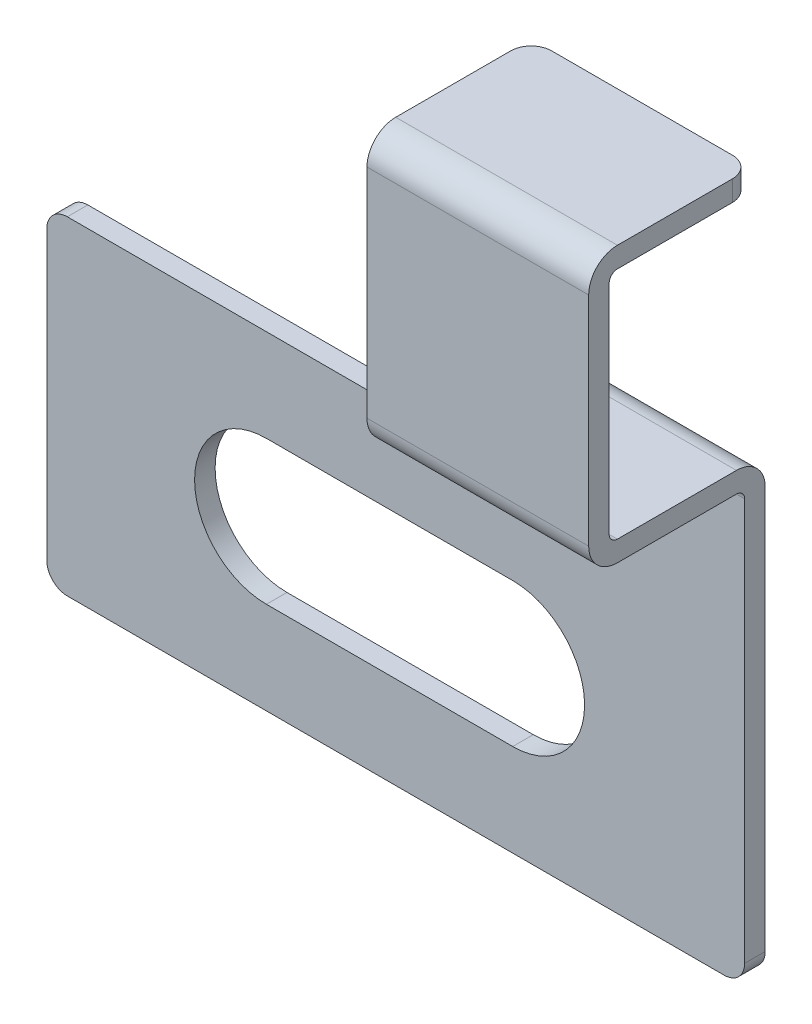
ISO-10303-21;
HEADER;
FILE_DESCRIPTION(('STEP AP214'),'2;1');
FILE_NAME('part.step','',(''),(''),'','','');
FILE_SCHEMA(('AUTOMOTIVE_DESIGN { 1 0 10303 214 1 1 1 1 }'));
ENDSEC;
DATA;
#1=APPLICATION_CONTEXT('core data for automotive mechanical design processes');
#2=APPLICATION_PROTOCOL_DEFINITION('international standard','automotive_design',2000,#1);
#3=PRODUCT_CONTEXT('',#1,'mechanical');
#4=PRODUCT('Part','Part','',(#3));
#5=PRODUCT_RELATED_PRODUCT_CATEGORY('part','',(#4));
#6=PRODUCT_DEFINITION_FORMATION('','',#4);
#7=PRODUCT_DEFINITION_CONTEXT('part definition',#1,'design');
#8=PRODUCT_DEFINITION('design','',#6,#7);
#9=PRODUCT_DEFINITION_SHAPE('','',#8);
#10=(LENGTH_UNIT() NAMED_UNIT(*) SI_UNIT(.MILLI.,.METRE.));
#11=(NAMED_UNIT(*) PLANE_ANGLE_UNIT() SI_UNIT($,.RADIAN.));
#12=(NAMED_UNIT(*) SI_UNIT($,.STERADIAN.) SOLID_ANGLE_UNIT());
#13=UNCERTAINTY_MEASURE_WITH_UNIT(LENGTH_MEASURE(1.E-05),#10,'distance_accuracy_value','');
#14=(GEOMETRIC_REPRESENTATION_CONTEXT(3) GLOBAL_UNCERTAINTY_ASSIGNED_CONTEXT((#13)) GLOBAL_UNIT_ASSIGNED_CONTEXT((#10,
#11,#12)) REPRESENTATION_CONTEXT('',''));
#15=CARTESIAN_POINT('',(0.,0.,0.));
#16=DIRECTION('',(0.,0.,1.));
#17=DIRECTION('',(1.,0.,0.));
#18=AXIS2_PLACEMENT_3D('',#15,#16,#17);
#19=CARTESIAN_POINT('',(-5.35,12.7,3.6));
#20=DIRECTION('',(0.,-1.,0.));
#21=DIRECTION('',(-1.,0.,0.));
#22=AXIS2_PLACEMENT_3D('',#19,#20,#21);
#23=PLANE('',#22);
#24=DIRECTION('',(1.,0.,0.));
#25=VECTOR('',#24,1.);
#26=CARTESIAN_POINT('',(-5.35,12.7,0.3));
#27=LINE('',#26,#25);
#28=CARTESIAN_POINT('',(6.75,12.7,0.3));
#29=VERTEX_POINT('',#28);
#30=CARTESIAN_POINT('',(11.15,12.7,0.3));
#31=VERTEX_POINT('',#30);
#32=EDGE_CURVE('E281',#29,#31,#27,.T.);
#33=ORIENTED_EDGE('',*,*,#32,.T.);
#34=CARTESIAN_POINT('',(11.15,12.7,0.8));
#35=DIRECTION('',(0.,-1.,0.));
#36=DIRECTION('',(-1.,0.,0.));
#37=AXIS2_PLACEMENT_3D('',#34,#35,#36);
#38=CIRCLE('',#37,0.5);
#39=CARTESIAN_POINT('',(11.65,12.7,0.8));
#40=VERTEX_POINT('',#39);
#41=EDGE_CURVE('E396',#31,#40,#38,.T.);
#42=ORIENTED_EDGE('',*,*,#41,.T.);
#43=DIRECTION('',(0.,0.,-1.));
#44=VECTOR('',#43,1.);
#45=CARTESIAN_POINT('',(11.65,12.7,3.6));
#46=LINE('',#45,#44);
#47=CARTESIAN_POINT('',(11.65,12.7,3.6));
#48=VERTEX_POINT('',#47);
#49=EDGE_CURVE('E273',#48,#40,#46,.T.);
#50=ORIENTED_EDGE('',*,*,#49,.F.);
#51=DIRECTION('',(1.,0.,0.));
#52=VECTOR('',#51,1.);
#53=CARTESIAN_POINT('',(-5.35,12.7,3.6));
#54=LINE('',#53,#52);
#55=CARTESIAN_POINT('',(6.25,12.7,3.6));
#56=VERTEX_POINT('',#55);
#57=EDGE_CURVE('E320',#56,#48,#54,.T.);
#58=ORIENTED_EDGE('',*,*,#57,.F.);
#59=DIRECTION('',(0.,0.,1.));
#60=VECTOR('',#59,1.);
#61=CARTESIAN_POINT('',(6.25,12.7,3.6));
#62=LINE('',#61,#60);
#63=CARTESIAN_POINT('',(6.25,12.7,0.8));
#64=VERTEX_POINT('',#63);
#65=EDGE_CURVE('E245',#64,#56,#62,.T.);
#66=ORIENTED_EDGE('',*,*,#65,.F.);
#67=CARTESIAN_POINT('',(6.75,12.7,0.8));
#68=DIRECTION('',(0.,-1.,0.));
#69=DIRECTION('',(-1.,0.,0.));
#70=AXIS2_PLACEMENT_3D('',#67,#68,#69);
#71=CIRCLE('',#70,0.5);
#72=EDGE_CURVE('E394',#64,#29,#71,.T.);
#73=ORIENTED_EDGE('',*,*,#72,.T.);
#74=EDGE_LOOP('',(#33,#42,#50,#58,#66,#73));
#75=FACE_BOUND('',#74,.T.);
#76=ADVANCED_FACE('F14',(#75),#23,.T.);
#77=CARTESIAN_POINT('',(-5.35,12.5,3.6));
#78=DIRECTION('',(1.,0.,0.));
#79=DIRECTION('',(0.,0.,-1.));
#80=AXIS2_PLACEMENT_3D('',#77,#78,#79);
#81=CYLINDRICAL_SURFACE('',#80,0.2);
#82=CARTESIAN_POINT('',(6.25,12.5,3.6));
#83=DIRECTION('',(1.,0.,0.));
#84=DIRECTION('',(0.,-1.,0.));
#85=AXIS2_PLACEMENT_3D('',#82,#83,#84);
#86=CIRCLE('',#85,0.2);
#87=CARTESIAN_POINT('',(6.25,12.5,3.8));
#88=VERTEX_POINT('',#87);
#89=EDGE_CURVE('E247',#56,#88,#86,.T.);
#90=ORIENTED_EDGE('',*,*,#89,.F.);
#91=ORIENTED_EDGE('',*,*,#57,.T.);
#92=CARTESIAN_POINT('',(11.65,12.5,3.6));
#93=DIRECTION('',(-1.,0.,0.));
#94=DIRECTION('',(0.,0.,1.));
#95=AXIS2_PLACEMENT_3D('',#92,#93,#94);
#96=CIRCLE('',#95,0.2);
#97=CARTESIAN_POINT('',(11.65,12.5,3.8));
#98=VERTEX_POINT('',#97);
#99=EDGE_CURVE('E278',#98,#48,#96,.T.);
#100=ORIENTED_EDGE('',*,*,#99,.F.);
#101=DIRECTION('',(1.,0.,0.));
#102=VECTOR('',#101,1.);
#103=CARTESIAN_POINT('',(-5.35,12.5,3.8));
#104=LINE('',#103,#102);
#105=EDGE_CURVE('E323',#88,#98,#104,.T.);
#106=ORIENTED_EDGE('',*,*,#105,.F.);
#107=EDGE_LOOP('',(#90,#91,#100,#106));
#108=FACE_BOUND('',#107,.T.);
#109=ADVANCED_FACE('F468',(#108),#81,.F.);
#110=CARTESIAN_POINT('',(-5.35,7.2,3.8));
#111=DIRECTION('',(0.,0.,-1.));
#112=DIRECTION('',(-1.,0.,0.));
#113=AXIS2_PLACEMENT_3D('',#110,#111,#112);
#114=PLANE('',#113);
#115=DIRECTION('',(0.,-1.,0.));
#116=VECTOR('',#115,1.);
#117=CARTESIAN_POINT('',(6.25,7.2,3.8));
#118=LINE('',#117,#116);
#119=CARTESIAN_POINT('',(6.25,7.2,3.8));
#120=VERTEX_POINT('',#119);
#121=EDGE_CURVE('E249',#88,#120,#118,.T.);
#122=ORIENTED_EDGE('',*,*,#121,.F.);
#123=ORIENTED_EDGE('',*,*,#105,.T.);
#124=DIRECTION('',(0.,1.,0.));
#125=VECTOR('',#124,1.);
#126=CARTESIAN_POINT('',(11.65,7.2,3.8));
#127=LINE('',#126,#125);
#128=CARTESIAN_POINT('',(11.65,7.2,3.8));
#129=VERTEX_POINT('',#128);
#130=EDGE_CURVE('E315',#129,#98,#127,.T.);
#131=ORIENTED_EDGE('',*,*,#130,.F.);
#132=DIRECTION('',(1.,0.,0.));
#133=VECTOR('',#132,1.);
#134=CARTESIAN_POINT('',(-5.35,7.2,3.8));
#135=LINE('',#134,#133);
#136=EDGE_CURVE('E325',#120,#129,#135,.T.);
#137=ORIENTED_EDGE('',*,*,#136,.F.);
#138=EDGE_LOOP('',(#122,#123,#131,#137));
#139=FACE_BOUND('',#138,.T.);
#140=ADVANCED_FACE('F475',(#139),#114,.T.);
#141=CARTESIAN_POINT('',(-5.35,7.2,3.6));
#142=DIRECTION('',(1.,0.,0.));
#143=DIRECTION('',(0.,0.,-1.));
#144=AXIS2_PLACEMENT_3D('',#141,#142,#143);
#145=CYLINDRICAL_SURFACE('',#144,0.2);
#146=CARTESIAN_POINT('',(6.25,7.2,3.6));
#147=DIRECTION('',(1.,0.,0.));
#148=DIRECTION('',(0.,-1.,0.));
#149=AXIS2_PLACEMENT_3D('',#146,#147,#148);
#150=CIRCLE('',#149,0.2);
#151=CARTESIAN_POINT('',(6.25,7.,3.6));
#152=VERTEX_POINT('',#151);
#153=EDGE_CURVE('E251',#120,#152,#150,.T.);
#154=ORIENTED_EDGE('',*,*,#153,.F.);
#155=ORIENTED_EDGE('',*,*,#136,.T.);
#156=CARTESIAN_POINT('',(11.65,7.2,3.6));
#157=DIRECTION('',(-1.,0.,0.));
#158=DIRECTION('',(0.,0.,1.));
#159=AXIS2_PLACEMENT_3D('',#156,#157,#158);
#160=CIRCLE('',#159,0.2);
#161=CARTESIAN_POINT('',(11.65,7.,3.6));
#162=VERTEX_POINT('',#161);
#163=EDGE_CURVE('E312',#162,#129,#160,.T.);
#164=ORIENTED_EDGE('',*,*,#163,.F.);
#165=DIRECTION('',(1.,0.,0.));
#166=VECTOR('',#165,1.);
#167=CARTESIAN_POINT('',(-5.35,7.,3.6));
#168=LINE('',#167,#166);
#169=EDGE_CURVE('E327',#152,#162,#168,.T.);
#170=ORIENTED_EDGE('',*,*,#169,.F.);
#171=EDGE_LOOP('',(#154,#155,#164,#170));
#172=FACE_BOUND('',#171,.T.);
#173=ADVANCED_FACE('F502',(#172),#145,.F.);
#174=CARTESIAN_POINT('',(-5.35,7.,0.7));
#175=DIRECTION('',(0.,1.,0.));
#176=DIRECTION('',(0.,0.,1.));
#177=AXIS2_PLACEMENT_3D('',#174,#175,#176);
#178=PLANE('',#177);
#179=DIRECTION('',(0.,0.,-1.));
#180=VECTOR('',#179,1.);
#181=CARTESIAN_POINT('',(6.25,7.,0.7));
#182=LINE('',#181,#180);
#183=CARTESIAN_POINT('',(6.25,7.,0.7));
#184=VERTEX_POINT('',#183);
#185=EDGE_CURVE('E253',#152,#184,#182,.T.);
#186=ORIENTED_EDGE('',*,*,#185,.F.);
#187=ORIENTED_EDGE('',*,*,#169,.T.);
#188=DIRECTION('',(0.,0.,1.));
#189=VECTOR('',#188,1.);
#190=CARTESIAN_POINT('',(11.65,7.,0.7));
#191=LINE('',#190,#189);
#192=CARTESIAN_POINT('',(11.65,7.,0.7));
#193=VERTEX_POINT('',#192);
#194=EDGE_CURVE('E309',#193,#162,#191,.T.);
#195=ORIENTED_EDGE('',*,*,#194,.F.);
#196=DIRECTION('',(1.,0.,0.));
#197=VECTOR('',#196,1.);
#198=CARTESIAN_POINT('',(-5.35,7.,0.7));
#199=LINE('',#198,#197);
#200=EDGE_CURVE('E329',#184,#193,#199,.T.);
#201=ORIENTED_EDGE('',*,*,#200,.F.);
#202=EDGE_LOOP('',(#186,#187,#195,#201));
#203=FACE_BOUND('',#202,.T.);
#204=ADVANCED_FACE('F506',(#203),#178,.T.);
#205=CARTESIAN_POINT('',(-5.35,6.3,0.7));
#206=DIRECTION('',(1.,0.,0.));
#207=DIRECTION('',(0.,0.,-1.));
#208=AXIS2_PLACEMENT_3D('',#205,#206,#207);
#209=CYLINDRICAL_SURFACE('',#208,0.7);
#210=CARTESIAN_POINT('',(6.25,6.3,0.7));
#211=DIRECTION('',(1.,0.,0.));
#212=DIRECTION('',(0.,-1.,0.));
#213=AXIS2_PLACEMENT_3D('',#210,#211,#212);
#214=CIRCLE('',#213,0.7);
#215=CARTESIAN_POINT('',(6.25,6.3,0.));
#216=VERTEX_POINT('',#215);
#217=EDGE_CURVE('E255',#184,#216,#214,.F.);
#218=ORIENTED_EDGE('',*,*,#217,.F.);
#219=ORIENTED_EDGE('',*,*,#200,.T.);
#220=CARTESIAN_POINT('',(11.65,6.3,0.7));
#221=DIRECTION('',(1.,0.,0.));
#222=DIRECTION('',(0.,0.,-1.));
#223=AXIS2_PLACEMENT_3D('',#220,#221,#222);
#224=CIRCLE('',#223,0.7);
#225=CARTESIAN_POINT('',(11.65,6.3,0.));
#226=VERTEX_POINT('',#225);
#227=EDGE_CURVE('E306',#226,#193,#224,.T.);
#228=ORIENTED_EDGE('',*,*,#227,.F.);
#229=DIRECTION('',(1.,0.,0.));
#230=VECTOR('',#229,1.);
#231=CARTESIAN_POINT('',(-5.35,6.3,0.));
#232=LINE('',#231,#230);
#233=EDGE_CURVE('E331',#216,#226,#232,.T.);
#234=ORIENTED_EDGE('',*,*,#233,.F.);
#235=EDGE_LOOP('',(#218,#219,#228,#234));
#236=FACE_BOUND('',#235,.T.);
#237=ADVANCED_FACE('F429',(#236),#209,.T.);
#238=CARTESIAN_POINT('',(-5.35,6.3,0.));
#239=DIRECTION('',(0.,0.,-1.));
#240=DIRECTION('',(0.,1.,0.));
#241=AXIS2_PLACEMENT_3D('',#238,#239,#240);
#242=PLANE('',#241);
#243=CARTESIAN_POINT('',(0.,0.,0.));
#244=DIRECTION('',(0.,0.,-1.));
#245=DIRECTION('',(0.,1.,0.));
#246=AXIS2_PLACEMENT_3D('',#243,#244,#245);
#247=CIRCLE('',#246,1.75);
#248=CARTESIAN_POINT('',(0.,-1.75,0.));
#249=VERTEX_POINT('',#248);
#250=CARTESIAN_POINT('',(0.,1.75,0.));
#251=VERTEX_POINT('',#250);
#252=EDGE_CURVE('E231',#249,#251,#247,.T.);
#253=ORIENTED_EDGE('',*,*,#252,.F.);
#254=DIRECTION('',(-1.,0.,0.));
#255=VECTOR('',#254,1.);
#256=CARTESIAN_POINT('',(-5.35,-1.75,0.));
#257=LINE('',#256,#255);
#258=CARTESIAN_POINT('',(6.,-1.75,0.));
#259=VERTEX_POINT('',#258);
#260=EDGE_CURVE('E224',#259,#249,#257,.T.);
#261=ORIENTED_EDGE('',*,*,#260,.F.);
#262=CARTESIAN_POINT('',(6.,0.,0.));
#263=DIRECTION('',(0.,0.,-1.));
#264=DIRECTION('',(0.,1.,0.));
#265=AXIS2_PLACEMENT_3D('',#262,#263,#264);
#266=CIRCLE('',#265,1.75);
#267=CARTESIAN_POINT('',(6.,1.75,0.));
#268=VERTEX_POINT('',#267);
#269=EDGE_CURVE('E204',#268,#259,#266,.T.);
#270=ORIENTED_EDGE('',*,*,#269,.F.);
#271=DIRECTION('',(1.,0.,0.));
#272=VECTOR('',#271,1.);
#273=CARTESIAN_POINT('',(-5.35,1.75,0.));
#274=LINE('',#273,#272);
#275=EDGE_CURVE('E229',#251,#268,#274,.T.);
#276=ORIENTED_EDGE('',*,*,#275,.F.);
#277=EDGE_LOOP('',(#253,#261,#270,#276));
#278=FACE_BOUND('',#277,.T.);
#279=DIRECTION('',(0.,1.,0.));
#280=VECTOR('',#279,1.);
#281=CARTESIAN_POINT('',(11.65,6.3,0.));
#282=LINE('',#281,#280);
#283=CARTESIAN_POINT('',(11.65,-3.5,0.));
#284=VERTEX_POINT('',#283);
#285=EDGE_CURVE('E304',#284,#226,#282,.T.);
#286=ORIENTED_EDGE('',*,*,#285,.F.);
#287=CARTESIAN_POINT('',(11.15,-3.5,0.));
#288=DIRECTION('',(0.,0.,-1.));
#289=DIRECTION('',(0.,1.,0.));
#290=AXIS2_PLACEMENT_3D('',#287,#288,#289);
#291=CIRCLE('',#290,0.5);
#292=CARTESIAN_POINT('',(11.15,-4.,0.));
#293=VERTEX_POINT('',#292);
#294=EDGE_CURVE('E376',#284,#293,#291,.T.);
#295=ORIENTED_EDGE('',*,*,#294,.T.);
#296=DIRECTION('',(1.,0.,0.));
#297=VECTOR('',#296,1.);
#298=CARTESIAN_POINT('',(-5.35,-4.,0.));
#299=LINE('',#298,#297);
#300=CARTESIAN_POINT('',(-4.85,-4.,0.));
#301=VERTEX_POINT('',#300);
#302=EDGE_CURVE('E334',#301,#293,#299,.T.);
#303=ORIENTED_EDGE('',*,*,#302,.F.);
#304=CARTESIAN_POINT('',(-4.85,-3.5,0.));
#305=DIRECTION('',(0.,0.,-1.));
#306=DIRECTION('',(0.,1.,0.));
#307=AXIS2_PLACEMENT_3D('',#304,#305,#306);
#308=CIRCLE('',#307,0.5);
#309=CARTESIAN_POINT('',(-5.35,-3.5,0.));
#310=VERTEX_POINT('',#309);
#311=EDGE_CURVE('E374',#301,#310,#308,.T.);
#312=ORIENTED_EDGE('',*,*,#311,.T.);
#313=DIRECTION('',(0.,1.,0.));
#314=VECTOR('',#313,1.);
#315=CARTESIAN_POINT('',(-5.35,6.3,0.));
#316=LINE('',#315,#314);
#317=CARTESIAN_POINT('',(-5.35,3.5,0.));
#318=VERTEX_POINT('',#317);
#319=EDGE_CURVE('E277',#310,#318,#316,.T.);
#320=ORIENTED_EDGE('',*,*,#319,.T.);
#321=CARTESIAN_POINT('',(-4.85,3.5,0.));
#322=DIRECTION('',(0.,0.,-1.));
#323=DIRECTION('',(0.,1.,0.));
#324=AXIS2_PLACEMENT_3D('',#321,#322,#323);
#325=CIRCLE('',#324,0.5);
#326=CARTESIAN_POINT('',(-4.85,4.,0.));
#327=VERTEX_POINT('',#326);
#328=EDGE_CURVE('E372',#318,#327,#325,.T.);
#329=ORIENTED_EDGE('',*,*,#328,.T.);
#330=DIRECTION('',(1.,0.,0.));
#331=VECTOR('',#330,1.);
#332=CARTESIAN_POINT('',(-5.35,4.,0.));
#333=LINE('',#332,#331);
#334=CARTESIAN_POINT('',(5.75,4.,0.));
#335=VERTEX_POINT('',#334);
#336=EDGE_CURVE('E234',#327,#335,#333,.T.);
#337=ORIENTED_EDGE('',*,*,#336,.T.);
#338=CARTESIAN_POINT('',(5.75,4.5,0.));
#339=DIRECTION('',(0.,0.,-1.));
#340=DIRECTION('',(0.,1.,0.));
#341=AXIS2_PLACEMENT_3D('',#338,#339,#340);
#342=CIRCLE('',#341,0.5);
#343=CARTESIAN_POINT('',(6.25,4.5,0.));
#344=VERTEX_POINT('',#343);
#345=EDGE_CURVE('E9',#335,#344,#342,.F.);
#346=ORIENTED_EDGE('',*,*,#345,.T.);
#347=DIRECTION('',(0.,1.,0.));
#348=VECTOR('',#347,1.);
#349=CARTESIAN_POINT('',(6.25,13.2,0.));
#350=LINE('',#349,#348);
#351=EDGE_CURVE('E237',#344,#216,#350,.T.);
#352=ORIENTED_EDGE('',*,*,#351,.T.);
#353=ORIENTED_EDGE('',*,*,#233,.T.);
#354=EDGE_LOOP('',(#286,#295,#303,#312,#320,#329,#337,#346,#352,#353));
#355=FACE_BOUND('',#354,.T.);
#356=ADVANCED_FACE('F419',(#278,#355),#242,.T.);
#357=CARTESIAN_POINT('',(-5.35,-4.,0.));
#358=DIRECTION('',(0.,1.,0.));
#359=DIRECTION('',(1.,0.,0.));
#360=AXIS2_PLACEMENT_3D('',#357,#358,#359);
#361=PLANE('',#360);
#362=ORIENTED_EDGE('',*,*,#302,.T.);
#363=DIRECTION('',(0.,0.,1.));
#364=VECTOR('',#363,1.);
#365=CARTESIAN_POINT('',(11.15,-4.,0.5));
#366=LINE('',#365,#364);
#367=CARTESIAN_POINT('',(11.15,-4.,0.5));
#368=VERTEX_POINT('',#367);
#369=EDGE_CURVE('E359',#293,#368,#366,.T.);
#370=ORIENTED_EDGE('',*,*,#369,.T.);
#371=DIRECTION('',(1.,0.,0.));
#372=VECTOR('',#371,1.);
#373=CARTESIAN_POINT('',(-5.35,-4.,0.5));
#374=LINE('',#373,#372);
#375=CARTESIAN_POINT('',(-4.85,-4.,0.5));
#376=VERTEX_POINT('',#375);
#377=EDGE_CURVE('E337',#376,#368,#374,.T.);
#378=ORIENTED_EDGE('',*,*,#377,.F.);
#379=DIRECTION('',(0.,0.,1.));
#380=VECTOR('',#379,1.);
#381=CARTESIAN_POINT('',(-4.85,-4.,0.));
#382=LINE('',#381,#380);
#383=EDGE_CURVE('E322',#376,#301,#382,.F.);
#384=ORIENTED_EDGE('',*,*,#383,.T.);
#385=EDGE_LOOP('',(#362,#370,#378,#384));
#386=FACE_BOUND('',#385,.T.);
#387=ADVANCED_FACE('F439',(#386),#361,.F.);
#388=CARTESIAN_POINT('',(-5.35,6.3,0.5));
#389=DIRECTION('',(0.,0.,-1.));
#390=DIRECTION('',(0.,1.,0.));
#391=AXIS2_PLACEMENT_3D('',#388,#389,#390);
#392=PLANE('',#391);
#393=DIRECTION('',(1.,0.,0.));
#394=VECTOR('',#393,1.);
#395=CARTESIAN_POINT('',(0.,-1.75,0.5));
#396=LINE('',#395,#394);
#397=CARTESIAN_POINT('',(0.,-1.75,0.5));
#398=VERTEX_POINT('',#397);
#399=CARTESIAN_POINT('',(6.,-1.75,0.5));
#400=VERTEX_POINT('',#399);
#401=EDGE_CURVE('E210',#398,#400,#396,.T.);
#402=ORIENTED_EDGE('',*,*,#401,.F.);
#403=CARTESIAN_POINT('',(0.,0.,0.5));
#404=DIRECTION('',(0.,0.,1.));
#405=DIRECTION('',(0.,1.,0.));
#406=AXIS2_PLACEMENT_3D('',#403,#404,#405);
#407=CIRCLE('',#406,1.75);
#408=CARTESIAN_POINT('',(0.,1.75,0.5));
#409=VERTEX_POINT('',#408);
#410=EDGE_CURVE('E37',#409,#398,#407,.T.);
#411=ORIENTED_EDGE('',*,*,#410,.F.);
#412=DIRECTION('',(-1.,0.,0.));
#413=VECTOR('',#412,1.);
#414=CARTESIAN_POINT('',(0.,1.75,0.5));
#415=LINE('',#414,#413);
#416=CARTESIAN_POINT('',(6.,1.75,0.5));
#417=VERTEX_POINT('',#416);
#418=EDGE_CURVE('E217',#417,#409,#415,.T.);
#419=ORIENTED_EDGE('',*,*,#418,.F.);
#420=CARTESIAN_POINT('',(6.,0.,0.5));
#421=DIRECTION('',(0.,0.,1.));
#422=DIRECTION('',(0.,1.,0.));
#423=AXIS2_PLACEMENT_3D('',#420,#421,#422);
#424=CIRCLE('',#423,1.75);
#425=EDGE_CURVE('E201',#400,#417,#424,.T.);
#426=ORIENTED_EDGE('',*,*,#425,.F.);
#427=EDGE_LOOP('',(#402,#411,#419,#426));
#428=FACE_BOUND('',#427,.T.);
#429=ORIENTED_EDGE('',*,*,#377,.T.);
#430=CARTESIAN_POINT('',(11.15,-3.5,0.5));
#431=DIRECTION('',(0.,0.,-1.));
#432=DIRECTION('',(0.,1.,0.));
#433=AXIS2_PLACEMENT_3D('',#430,#431,#432);
#434=CIRCLE('',#433,0.5);
#435=CARTESIAN_POINT('',(11.65,-3.5,0.5));
#436=VERTEX_POINT('',#435);
#437=EDGE_CURVE('E366',#368,#436,#434,.F.);
#438=ORIENTED_EDGE('',*,*,#437,.T.);
#439=DIRECTION('',(0.,1.,0.));
#440=VECTOR('',#439,1.);
#441=CARTESIAN_POINT('',(11.65,6.3,0.5));
#442=LINE('',#441,#440);
#443=CARTESIAN_POINT('',(11.65,6.3,0.5));
#444=VERTEX_POINT('',#443);
#445=EDGE_CURVE('E302',#436,#444,#442,.T.);
#446=ORIENTED_EDGE('',*,*,#445,.T.);
#447=DIRECTION('',(1.,0.,0.));
#448=VECTOR('',#447,1.);
#449=CARTESIAN_POINT('',(-5.35,6.3,0.5));
#450=LINE('',#449,#448);
#451=CARTESIAN_POINT('',(6.25,6.3,0.5));
#452=VERTEX_POINT('',#451);
#453=EDGE_CURVE('E340',#452,#444,#450,.T.);
#454=ORIENTED_EDGE('',*,*,#453,.F.);
#455=DIRECTION('',(0.,-1.,0.));
#456=VECTOR('',#455,1.);
#457=CARTESIAN_POINT('',(6.25,6.3,0.5));
#458=LINE('',#457,#456);
#459=CARTESIAN_POINT('',(6.25,4.5,0.5));
#460=VERTEX_POINT('',#459);
#461=EDGE_CURVE('E270',#452,#460,#458,.T.);
#462=ORIENTED_EDGE('',*,*,#461,.T.);
#463=CARTESIAN_POINT('',(5.75,4.5,0.5));
#464=DIRECTION('',(0.,0.,-1.));
#465=DIRECTION('',(0.,1.,0.));
#466=AXIS2_PLACEMENT_3D('',#463,#464,#465);
#467=CIRCLE('',#466,0.5);
#468=CARTESIAN_POINT('',(5.75,4.,0.5));
#469=VERTEX_POINT('',#468);
#470=EDGE_CURVE('E22',#460,#469,#467,.T.);
#471=ORIENTED_EDGE('',*,*,#470,.T.);
#472=DIRECTION('',(-1.,0.,0.));
#473=VECTOR('',#472,1.);
#474=CARTESIAN_POINT('',(-5.35,4.,0.5));
#475=LINE('',#474,#473);
#476=CARTESIAN_POINT('',(-4.85,4.,0.5));
#477=VERTEX_POINT('',#476);
#478=EDGE_CURVE('E242',#469,#477,#475,.T.);
#479=ORIENTED_EDGE('',*,*,#478,.T.);
#480=CARTESIAN_POINT('',(-4.85,3.5,0.5));
#481=DIRECTION('',(0.,0.,-1.));
#482=DIRECTION('',(0.,1.,0.));
#483=AXIS2_PLACEMENT_3D('',#480,#481,#482);
#484=CIRCLE('',#483,0.5);
#485=CARTESIAN_POINT('',(-5.35,3.5,0.5));
#486=VERTEX_POINT('',#485);
#487=EDGE_CURVE('E362',#477,#486,#484,.F.);
#488=ORIENTED_EDGE('',*,*,#487,.T.);
#489=DIRECTION('',(0.,1.,0.));
#490=VECTOR('',#489,1.);
#491=CARTESIAN_POINT('',(-5.35,6.3,0.5));
#492=LINE('',#491,#490);
#493=CARTESIAN_POINT('',(-5.35,-3.5,0.5));
#494=VERTEX_POINT('',#493);
#495=EDGE_CURVE('E274',#494,#486,#492,.T.);
#496=ORIENTED_EDGE('',*,*,#495,.F.);
#497=CARTESIAN_POINT('',(-4.85,-3.5,0.5));
#498=DIRECTION('',(0.,0.,-1.));
#499=DIRECTION('',(0.,1.,0.));
#500=AXIS2_PLACEMENT_3D('',#497,#498,#499);
#501=CIRCLE('',#500,0.5);
#502=EDGE_CURVE('E364',#494,#376,#501,.F.);
#503=ORIENTED_EDGE('',*,*,#502,.T.);
#504=EDGE_LOOP('',(#429,#438,#446,#454,#462,#471,#479,#488,#496,#503));
#505=FACE_BOUND('',#504,.T.);
#506=ADVANCED_FACE('F214',(#428,#505),#392,.F.);
#507=CARTESIAN_POINT('',(-5.35,6.3,0.7));
#508=DIRECTION('',(1.,0.,0.));
#509=DIRECTION('',(0.,0.,-1.));
#510=AXIS2_PLACEMENT_3D('',#507,#508,#509);
#511=CYLINDRICAL_SURFACE('',#510,0.2);
#512=DIRECTION('',(1.,0.,0.));
#513=VECTOR('',#512,1.);
#514=CARTESIAN_POINT('',(-5.35,6.5,0.7));
#515=LINE('',#514,#513);
#516=CARTESIAN_POINT('',(6.25,6.5,0.7));
#517=VERTEX_POINT('',#516);
#518=CARTESIAN_POINT('',(11.65,6.5,0.7));
#519=VERTEX_POINT('',#518);
#520=EDGE_CURVE('E343',#517,#519,#515,.T.);
#521=ORIENTED_EDGE('',*,*,#520,.F.);
#522=CARTESIAN_POINT('',(6.25,6.3,0.7));
#523=DIRECTION('',(1.,0.,0.));
#524=DIRECTION('',(0.,-1.,0.));
#525=AXIS2_PLACEMENT_3D('',#522,#523,#524);
#526=CIRCLE('',#525,0.2);
#527=EDGE_CURVE('E267',#517,#452,#526,.F.);
#528=ORIENTED_EDGE('',*,*,#527,.T.);
#529=ORIENTED_EDGE('',*,*,#453,.T.);
#530=CARTESIAN_POINT('',(11.65,6.3,0.7));
#531=DIRECTION('',(1.,0.,0.));
#532=DIRECTION('',(0.,0.,-1.));
#533=AXIS2_PLACEMENT_3D('',#530,#531,#532);
#534=CIRCLE('',#533,0.2);
#535=EDGE_CURVE('E299',#444,#519,#534,.T.);
#536=ORIENTED_EDGE('',*,*,#535,.T.);
#537=EDGE_LOOP('',(#521,#528,#529,#536));
#538=FACE_BOUND('',#537,.T.);
#539=ADVANCED_FACE('F520',(#538),#511,.F.);
#540=CARTESIAN_POINT('',(-5.35,6.5,0.7));
#541=DIRECTION('',(0.,1.,0.));
#542=DIRECTION('',(0.,0.,1.));
#543=AXIS2_PLACEMENT_3D('',#540,#541,#542);
#544=PLANE('',#543);
#545=DIRECTION('',(1.,0.,0.));
#546=VECTOR('',#545,1.);
#547=CARTESIAN_POINT('',(-5.35,6.5,3.6));
#548=LINE('',#547,#546);
#549=CARTESIAN_POINT('',(6.25,6.5,3.6));
#550=VERTEX_POINT('',#549);
#551=CARTESIAN_POINT('',(11.65,6.5,3.6));
#552=VERTEX_POINT('',#551);
#553=EDGE_CURVE('E345',#550,#552,#548,.T.);
#554=ORIENTED_EDGE('',*,*,#553,.F.);
#555=DIRECTION('',(0.,0.,-1.));
#556=VECTOR('',#555,1.);
#557=CARTESIAN_POINT('',(6.25,6.5,0.7));
#558=LINE('',#557,#556);
#559=EDGE_CURVE('E264',#550,#517,#558,.T.);
#560=ORIENTED_EDGE('',*,*,#559,.T.);
#561=ORIENTED_EDGE('',*,*,#520,.T.);
#562=DIRECTION('',(0.,0.,1.));
#563=VECTOR('',#562,1.);
#564=CARTESIAN_POINT('',(11.65,6.5,0.7));
#565=LINE('',#564,#563);
#566=EDGE_CURVE('E296',#519,#552,#565,.T.);
#567=ORIENTED_EDGE('',*,*,#566,.T.);
#568=EDGE_LOOP('',(#554,#560,#561,#567));
#569=FACE_BOUND('',#568,.T.);
#570=ADVANCED_FACE('F523',(#569),#544,.F.);
#571=CARTESIAN_POINT('',(-5.35,7.2,3.6));
#572=DIRECTION('',(1.,0.,0.));
#573=DIRECTION('',(0.,0.,-1.));
#574=AXIS2_PLACEMENT_3D('',#571,#572,#573);
#575=CYLINDRICAL_SURFACE('',#574,0.7);
#576=DIRECTION('',(1.,0.,0.));
#577=VECTOR('',#576,1.);
#578=CARTESIAN_POINT('',(-5.35,7.2,4.3));
#579=LINE('',#578,#577);
#580=CARTESIAN_POINT('',(6.25,7.2,4.3));
#581=VERTEX_POINT('',#580);
#582=CARTESIAN_POINT('',(11.65,7.2,4.3));
#583=VERTEX_POINT('',#582);
#584=EDGE_CURVE('E347',#581,#583,#579,.T.);
#585=ORIENTED_EDGE('',*,*,#584,.F.);
#586=CARTESIAN_POINT('',(6.25,7.2,3.6));
#587=DIRECTION('',(1.,0.,0.));
#588=DIRECTION('',(0.,-1.,0.));
#589=AXIS2_PLACEMENT_3D('',#586,#587,#588);
#590=CIRCLE('',#589,0.7);
#591=EDGE_CURVE('E261',#581,#550,#590,.T.);
#592=ORIENTED_EDGE('',*,*,#591,.T.);
#593=ORIENTED_EDGE('',*,*,#553,.T.);
#594=CARTESIAN_POINT('',(11.65,7.2,3.6));
#595=DIRECTION('',(1.,0.,0.));
#596=DIRECTION('',(0.,0.,-1.));
#597=AXIS2_PLACEMENT_3D('',#594,#595,#596);
#598=CIRCLE('',#597,0.7);
#599=EDGE_CURVE('E293',#552,#583,#598,.F.);
#600=ORIENTED_EDGE('',*,*,#599,.T.);
#601=EDGE_LOOP('',(#585,#592,#593,#600));
#602=FACE_BOUND('',#601,.T.);
#603=ADVANCED_FACE('F527',(#602),#575,.T.);
#604=CARTESIAN_POINT('',(-5.35,7.2,4.3));
#605=DIRECTION('',(0.,0.,-1.));
#606=DIRECTION('',(-1.,0.,0.));
#607=AXIS2_PLACEMENT_3D('',#604,#605,#606);
#608=PLANE('',#607);
#609=DIRECTION('',(1.,0.,0.));
#610=VECTOR('',#609,1.);
#611=CARTESIAN_POINT('',(-5.35,12.5,4.3));
#612=LINE('',#611,#610);
#613=CARTESIAN_POINT('',(6.25,12.5,4.3));
#614=VERTEX_POINT('',#613);
#615=CARTESIAN_POINT('',(11.65,12.5,4.3));
#616=VERTEX_POINT('',#615);
#617=EDGE_CURVE('E349',#614,#616,#612,.T.);
#618=ORIENTED_EDGE('',*,*,#617,.F.);
#619=DIRECTION('',(0.,1.,0.));
#620=VECTOR('',#619,1.);
#621=CARTESIAN_POINT('',(6.25,13.2,4.3));
#622=LINE('',#621,#620);
#623=EDGE_CURVE('E233',#581,#614,#622,.T.);
#624=ORIENTED_EDGE('',*,*,#623,.F.);
#625=ORIENTED_EDGE('',*,*,#584,.T.);
#626=DIRECTION('',(0.,1.,0.));
#627=VECTOR('',#626,1.);
#628=CARTESIAN_POINT('',(11.65,7.2,4.3));
#629=LINE('',#628,#627);
#630=EDGE_CURVE('E290',#583,#616,#629,.T.);
#631=ORIENTED_EDGE('',*,*,#630,.T.);
#632=EDGE_LOOP('',(#618,#624,#625,#631));
#633=FACE_BOUND('',#632,.T.);
#634=ADVANCED_FACE('F531',(#633),#608,.F.);
#635=CARTESIAN_POINT('',(-5.35,12.5,3.6));
#636=DIRECTION('',(1.,0.,0.));
#637=DIRECTION('',(0.,0.,-1.));
#638=AXIS2_PLACEMENT_3D('',#635,#636,#637);
#639=CYLINDRICAL_SURFACE('',#638,0.7);
#640=DIRECTION('',(1.,0.,0.));
#641=VECTOR('',#640,1.);
#642=CARTESIAN_POINT('',(-5.35,13.2,3.6));
#643=LINE('',#642,#641);
#644=CARTESIAN_POINT('',(6.25,13.2,3.6));
#645=VERTEX_POINT('',#644);
#646=CARTESIAN_POINT('',(11.65,13.2,3.6));
#647=VERTEX_POINT('',#646);
#648=EDGE_CURVE('E351',#645,#647,#643,.T.);
#649=ORIENTED_EDGE('',*,*,#648,.F.);
#650=CARTESIAN_POINT('',(6.25,12.5,3.6));
#651=DIRECTION('',(1.,0.,0.));
#652=DIRECTION('',(0.,-1.,0.));
#653=AXIS2_PLACEMENT_3D('',#650,#651,#652);
#654=CIRCLE('',#653,0.7);
#655=EDGE_CURVE('E258',#645,#614,#654,.T.);
#656=ORIENTED_EDGE('',*,*,#655,.T.);
#657=ORIENTED_EDGE('',*,*,#617,.T.);
#658=CARTESIAN_POINT('',(11.65,12.5,3.6));
#659=DIRECTION('',(1.,0.,0.));
#660=DIRECTION('',(0.,0.,-1.));
#661=AXIS2_PLACEMENT_3D('',#658,#659,#660);
#662=CIRCLE('',#661,0.7);
#663=EDGE_CURVE('E287',#616,#647,#662,.F.);
#664=ORIENTED_EDGE('',*,*,#663,.T.);
#665=EDGE_LOOP('',(#649,#656,#657,#664));
#666=FACE_BOUND('',#665,.T.);
#667=ADVANCED_FACE('F535',(#666),#639,.T.);
#668=CARTESIAN_POINT('',(-5.35,13.2,3.6));
#669=DIRECTION('',(0.,-1.,0.));
#670=DIRECTION('',(-1.,0.,0.));
#671=AXIS2_PLACEMENT_3D('',#668,#669,#670);
#672=PLANE('',#671);
#673=DIRECTION('',(0.,0.,-1.));
#674=VECTOR('',#673,1.);
#675=CARTESIAN_POINT('',(11.65,13.2,3.6));
#676=LINE('',#675,#674);
#677=CARTESIAN_POINT('',(11.65,13.2,0.8));
#678=VERTEX_POINT('',#677);
#679=EDGE_CURVE('E284',#647,#678,#676,.T.);
#680=ORIENTED_EDGE('',*,*,#679,.T.);
#681=CARTESIAN_POINT('',(11.15,13.2,0.8));
#682=DIRECTION('',(0.,-1.,0.));
#683=DIRECTION('',(-1.,0.,0.));
#684=AXIS2_PLACEMENT_3D('',#681,#682,#683);
#685=CIRCLE('',#684,0.5);
#686=CARTESIAN_POINT('',(11.15,13.2,0.3));
#687=VERTEX_POINT('',#686);
#688=EDGE_CURVE('E400',#678,#687,#685,.F.);
#689=ORIENTED_EDGE('',*,*,#688,.T.);
#690=DIRECTION('',(1.,0.,0.));
#691=VECTOR('',#690,1.);
#692=CARTESIAN_POINT('',(-5.35,13.2,0.3));
#693=LINE('',#692,#691);
#694=CARTESIAN_POINT('',(6.75,13.2,0.3));
#695=VERTEX_POINT('',#694);
#696=EDGE_CURVE('E353',#695,#687,#693,.T.);
#697=ORIENTED_EDGE('',*,*,#696,.F.);
#698=CARTESIAN_POINT('',(6.75,13.2,0.8));
#699=DIRECTION('',(0.,-1.,0.));
#700=DIRECTION('',(-1.,0.,0.));
#701=AXIS2_PLACEMENT_3D('',#698,#699,#700);
#702=CIRCLE('',#701,0.5);
#703=CARTESIAN_POINT('',(6.25,13.2,0.8));
#704=VERTEX_POINT('',#703);
#705=EDGE_CURVE('E398',#695,#704,#702,.F.);
#706=ORIENTED_EDGE('',*,*,#705,.T.);
#707=DIRECTION('',(0.,0.,1.));
#708=VECTOR('',#707,1.);
#709=CARTESIAN_POINT('',(6.25,13.2,0.));
#710=LINE('',#709,#708);
#711=EDGE_CURVE('E239',#704,#645,#710,.T.);
#712=ORIENTED_EDGE('',*,*,#711,.T.);
#713=ORIENTED_EDGE('',*,*,#648,.T.);
#714=EDGE_LOOP('',(#680,#689,#697,#706,#712,#713));
#715=FACE_BOUND('',#714,.T.);
#716=ADVANCED_FACE('F538',(#715),#672,.F.);
#717=CARTESIAN_POINT('',(-5.35,13.2,0.3));
#718=DIRECTION('',(0.,0.,1.));
#719=DIRECTION('',(1.,0.,0.));
#720=AXIS2_PLACEMENT_3D('',#717,#718,#719);
#721=PLANE('',#720);
#722=ORIENTED_EDGE('',*,*,#696,.T.);
#723=DIRECTION('',(0.,-1.,0.));
#724=VECTOR('',#723,1.);
#725=CARTESIAN_POINT('',(11.15,12.7,0.3));
#726=LINE('',#725,#724);
#727=EDGE_CURVE('E391',#687,#31,#726,.T.);
#728=ORIENTED_EDGE('',*,*,#727,.T.);
#729=ORIENTED_EDGE('',*,*,#32,.F.);
#730=DIRECTION('',(0.,1.,0.));
#731=VECTOR('',#730,1.);
#732=CARTESIAN_POINT('',(6.75,13.2,0.3));
#733=LINE('',#732,#731);
#734=EDGE_CURVE('E388',#29,#695,#733,.T.);
#735=ORIENTED_EDGE('',*,*,#734,.T.);
#736=EDGE_LOOP('',(#722,#728,#729,#735));
#737=FACE_BOUND('',#736,.T.);
#738=ADVANCED_FACE('F480',(#737),#721,.F.);
#739=CARTESIAN_POINT('',(-5.35,12.5,3.6));
#740=DIRECTION('',(1.,0.,0.));
#741=DIRECTION('',(0.,0.,-1.));
#742=AXIS2_PLACEMENT_3D('',#739,#740,#741);
#743=PLANE('',#742);
#744=ORIENTED_EDGE('',*,*,#319,.F.);
#745=DIRECTION('',(0.,0.,1.));
#746=VECTOR('',#745,1.);
#747=CARTESIAN_POINT('',(-5.35,-3.5,3.6));
#748=LINE('',#747,#746);
#749=EDGE_CURVE('E380',#310,#494,#748,.T.);
#750=ORIENTED_EDGE('',*,*,#749,.T.);
#751=ORIENTED_EDGE('',*,*,#495,.T.);
#752=DIRECTION('',(0.,0.,1.));
#753=VECTOR('',#752,1.);
#754=CARTESIAN_POINT('',(-5.35,3.5,3.6));
#755=LINE('',#754,#753);
#756=EDGE_CURVE('E378',#486,#318,#755,.F.);
#757=ORIENTED_EDGE('',*,*,#756,.T.);
#758=EDGE_LOOP('',(#744,#750,#751,#757));
#759=FACE_BOUND('',#758,.T.);
#760=ADVANCED_FACE('F449',(#759),#743,.F.);
#761=CARTESIAN_POINT('',(11.65,12.5,3.6));
#762=DIRECTION('',(1.,0.,0.));
#763=DIRECTION('',(0.,0.,-1.));
#764=AXIS2_PLACEMENT_3D('',#761,#762,#763);
#765=PLANE('',#764);
#766=ORIENTED_EDGE('',*,*,#445,.F.);
#767=DIRECTION('',(0.,0.,1.));
#768=VECTOR('',#767,1.);
#769=CARTESIAN_POINT('',(11.65,-3.5,0.));
#770=LINE('',#769,#768);
#771=EDGE_CURVE('E370',#436,#284,#770,.F.);
#772=ORIENTED_EDGE('',*,*,#771,.T.);
#773=ORIENTED_EDGE('',*,*,#285,.T.);
#774=ORIENTED_EDGE('',*,*,#227,.T.);
#775=ORIENTED_EDGE('',*,*,#194,.T.);
#776=ORIENTED_EDGE('',*,*,#163,.T.);
#777=ORIENTED_EDGE('',*,*,#130,.T.);
#778=ORIENTED_EDGE('',*,*,#99,.T.);
#779=ORIENTED_EDGE('',*,*,#49,.T.);
#780=DIRECTION('',(0.,-1.,0.));
#781=VECTOR('',#780,1.);
#782=CARTESIAN_POINT('',(11.65,13.2,0.8));
#783=LINE('',#782,#781);
#784=EDGE_CURVE('E368',#40,#678,#783,.F.);
#785=ORIENTED_EDGE('',*,*,#784,.T.);
#786=ORIENTED_EDGE('',*,*,#679,.F.);
#787=ORIENTED_EDGE('',*,*,#663,.F.);
#788=ORIENTED_EDGE('',*,*,#630,.F.);
#789=ORIENTED_EDGE('',*,*,#599,.F.);
#790=ORIENTED_EDGE('',*,*,#566,.F.);
#791=ORIENTED_EDGE('',*,*,#535,.F.);
#792=EDGE_LOOP('',(#766,#772,#773,#774,#775,#776,#777,#778,#779,#785,#786,#787,#788,#789,#790,#791));
#793=FACE_BOUND('',#792,.T.);
#794=ADVANCED_FACE('F492',(#793),#765,.T.);
#795=CARTESIAN_POINT('',(6.25,13.2,0.));
#796=DIRECTION('',(1.,0.,0.));
#797=DIRECTION('',(0.,-1.,0.));
#798=AXIS2_PLACEMENT_3D('',#795,#796,#797);
#799=PLANE('',#798);
#800=ORIENTED_EDGE('',*,*,#711,.F.);
#801=DIRECTION('',(0.,1.,0.));
#802=VECTOR('',#801,1.);
#803=CARTESIAN_POINT('',(6.25,13.2,0.8));
#804=LINE('',#803,#802);
#805=EDGE_CURVE('E405',#704,#64,#804,.F.);
#806=ORIENTED_EDGE('',*,*,#805,.T.);
#807=ORIENTED_EDGE('',*,*,#65,.T.);
#808=ORIENTED_EDGE('',*,*,#89,.T.);
#809=ORIENTED_EDGE('',*,*,#121,.T.);
#810=ORIENTED_EDGE('',*,*,#153,.T.);
#811=ORIENTED_EDGE('',*,*,#185,.T.);
#812=ORIENTED_EDGE('',*,*,#217,.T.);
#813=ORIENTED_EDGE('',*,*,#351,.F.);
#814=DIRECTION('',(0.,0.,1.));
#815=VECTOR('',#814,1.);
#816=CARTESIAN_POINT('',(6.25,4.5,0.5));
#817=LINE('',#816,#815);
#818=EDGE_CURVE('E402',#344,#460,#817,.T.);
#819=ORIENTED_EDGE('',*,*,#818,.T.);
#820=ORIENTED_EDGE('',*,*,#461,.F.);
#821=ORIENTED_EDGE('',*,*,#527,.F.);
#822=ORIENTED_EDGE('',*,*,#559,.F.);
#823=ORIENTED_EDGE('',*,*,#591,.F.);
#824=ORIENTED_EDGE('',*,*,#623,.T.);
#825=ORIENTED_EDGE('',*,*,#655,.F.);
#826=EDGE_LOOP('',(#800,#806,#807,#808,#809,#810,#811,#812,#813,#819,#820,#821,#822,#823,#824,#825));
#827=FACE_BOUND('',#826,.T.);
#828=ADVANCED_FACE('F422',(#827),#799,.F.);
#829=CARTESIAN_POINT('',(-5.35,4.,0.));
#830=DIRECTION('',(0.,-1.,0.));
#831=DIRECTION('',(-1.,0.,0.));
#832=AXIS2_PLACEMENT_3D('',#829,#830,#831);
#833=PLANE('',#832);
#834=ORIENTED_EDGE('',*,*,#336,.F.);
#835=DIRECTION('',(0.,0.,1.));
#836=VECTOR('',#835,1.);
#837=CARTESIAN_POINT('',(-4.85,4.,0.));
#838=LINE('',#837,#836);
#839=EDGE_CURVE('E385',#327,#477,#838,.T.);
#840=ORIENTED_EDGE('',*,*,#839,.T.);
#841=ORIENTED_EDGE('',*,*,#478,.F.);
#842=DIRECTION('',(0.,0.,1.));
#843=VECTOR('',#842,1.);
#844=CARTESIAN_POINT('',(5.75,4.,0.));
#845=LINE('',#844,#843);
#846=EDGE_CURVE('E383',#469,#335,#845,.F.);
#847=ORIENTED_EDGE('',*,*,#846,.T.);
#848=EDGE_LOOP('',(#834,#840,#841,#847));
#849=FACE_BOUND('',#848,.T.);
#850=ADVANCED_FACE('F413',(#849),#833,.F.);
#851=CARTESIAN_POINT('',(11.15,-3.5,0.));
#852=DIRECTION('',(0.,0.,-1.));
#853=DIRECTION('',(-1.,0.,0.));
#854=AXIS2_PLACEMENT_3D('',#851,#852,#853);
#855=CYLINDRICAL_SURFACE('',#854,0.5);
#856=ORIENTED_EDGE('',*,*,#294,.F.);
#857=ORIENTED_EDGE('',*,*,#771,.F.);
#858=ORIENTED_EDGE('',*,*,#437,.F.);
#859=ORIENTED_EDGE('',*,*,#369,.F.);
#860=EDGE_LOOP('',(#856,#857,#858,#859));
#861=FACE_BOUND('',#860,.T.);
#862=ADVANCED_FACE('F436',(#861),#855,.T.);
#863=CARTESIAN_POINT('',(-4.85,-3.5,3.6));
#864=DIRECTION('',(0.,0.,1.));
#865=DIRECTION('',(1.,0.,0.));
#866=AXIS2_PLACEMENT_3D('',#863,#864,#865);
#867=CYLINDRICAL_SURFACE('',#866,0.5);
#868=ORIENTED_EDGE('',*,*,#311,.F.);
#869=ORIENTED_EDGE('',*,*,#383,.F.);
#870=ORIENTED_EDGE('',*,*,#502,.F.);
#871=ORIENTED_EDGE('',*,*,#749,.F.);
#872=EDGE_LOOP('',(#868,#869,#870,#871));
#873=FACE_BOUND('',#872,.T.);
#874=ADVANCED_FACE('F446',(#873),#867,.T.);
#875=CARTESIAN_POINT('',(-4.85,3.5,0.));
#876=DIRECTION('',(0.,0.,1.));
#877=DIRECTION('',(1.,0.,0.));
#878=AXIS2_PLACEMENT_3D('',#875,#876,#877);
#879=CYLINDRICAL_SURFACE('',#878,0.5);
#880=ORIENTED_EDGE('',*,*,#328,.F.);
#881=ORIENTED_EDGE('',*,*,#756,.F.);
#882=ORIENTED_EDGE('',*,*,#487,.F.);
#883=ORIENTED_EDGE('',*,*,#839,.F.);
#884=EDGE_LOOP('',(#880,#881,#882,#883));
#885=FACE_BOUND('',#884,.T.);
#886=ADVANCED_FACE('F453',(#885),#879,.T.);
#887=CARTESIAN_POINT('',(11.15,13.2,0.8));
#888=DIRECTION('',(0.,1.,0.));
#889=DIRECTION('',(1.,0.,0.));
#890=AXIS2_PLACEMENT_3D('',#887,#888,#889);
#891=CYLINDRICAL_SURFACE('',#890,0.5);
#892=ORIENTED_EDGE('',*,*,#688,.F.);
#893=ORIENTED_EDGE('',*,*,#784,.F.);
#894=ORIENTED_EDGE('',*,*,#41,.F.);
#895=ORIENTED_EDGE('',*,*,#727,.F.);
#896=EDGE_LOOP('',(#892,#893,#894,#895));
#897=FACE_BOUND('',#896,.T.);
#898=ADVANCED_FACE('F455',(#897),#891,.T.);
#899=CARTESIAN_POINT('',(6.75,13.2,0.8));
#900=DIRECTION('',(0.,1.,0.));
#901=DIRECTION('',(1.,0.,0.));
#902=AXIS2_PLACEMENT_3D('',#899,#900,#901);
#903=CYLINDRICAL_SURFACE('',#902,0.5);
#904=ORIENTED_EDGE('',*,*,#72,.F.);
#905=ORIENTED_EDGE('',*,*,#805,.F.);
#906=ORIENTED_EDGE('',*,*,#705,.F.);
#907=ORIENTED_EDGE('',*,*,#734,.F.);
#908=EDGE_LOOP('',(#904,#905,#906,#907));
#909=FACE_BOUND('',#908,.T.);
#910=ADVANCED_FACE('F463',(#909),#903,.T.);
#911=CARTESIAN_POINT('',(5.75,4.5,0.));
#912=DIRECTION('',(0.,0.,-1.));
#913=DIRECTION('',(-1.,0.,0.));
#914=AXIS2_PLACEMENT_3D('',#911,#912,#913);
#915=CYLINDRICAL_SURFACE('',#914,0.5);
#916=ORIENTED_EDGE('',*,*,#345,.F.);
#917=ORIENTED_EDGE('',*,*,#846,.F.);
#918=ORIENTED_EDGE('',*,*,#470,.F.);
#919=ORIENTED_EDGE('',*,*,#818,.F.);
#920=EDGE_LOOP('',(#916,#917,#918,#919));
#921=FACE_BOUND('',#920,.T.);
#922=ADVANCED_FACE('F16',(#921),#915,.F.);
#923=CARTESIAN_POINT('',(0.,0.,-14.5));
#924=DIRECTION('',(0.,0.,1.));
#925=DIRECTION('',(0.,-1.,0.));
#926=AXIS2_PLACEMENT_3D('',#923,#924,#925);
#927=CYLINDRICAL_SURFACE('',#926,1.75);
#928=ORIENTED_EDGE('',*,*,#252,.T.);
#929=DIRECTION('',(0.,0.,1.));
#930=VECTOR('',#929,1.);
#931=CARTESIAN_POINT('',(0.,1.75,-14.5));
#932=LINE('',#931,#930);
#933=EDGE_CURVE('E222',#251,#409,#932,.T.);
#934=ORIENTED_EDGE('',*,*,#933,.T.);
#935=ORIENTED_EDGE('',*,*,#410,.T.);
#936=DIRECTION('',(0.,0.,1.));
#937=VECTOR('',#936,1.);
#938=CARTESIAN_POINT('',(0.,-1.75,-14.5));
#939=LINE('',#938,#937);
#940=EDGE_CURVE('E207',#249,#398,#939,.T.);
#941=ORIENTED_EDGE('',*,*,#940,.F.);
#942=EDGE_LOOP('',(#928,#934,#935,#941));
#943=FACE_BOUND('',#942,.T.);
#944=ADVANCED_FACE('F587',(#943),#927,.F.);
#945=CARTESIAN_POINT('',(0.,1.75,-14.5));
#946=DIRECTION('',(0.,1.,0.));
#947=DIRECTION('',(1.,0.,0.));
#948=AXIS2_PLACEMENT_3D('',#945,#946,#947);
#949=PLANE('',#948);
#950=ORIENTED_EDGE('',*,*,#275,.T.);
#951=DIRECTION('',(0.,0.,1.));
#952=VECTOR('',#951,1.);
#953=CARTESIAN_POINT('',(6.,1.75,-14.5));
#954=LINE('',#953,#952);
#955=EDGE_CURVE('E206',#268,#417,#954,.T.);
#956=ORIENTED_EDGE('',*,*,#955,.T.);
#957=ORIENTED_EDGE('',*,*,#418,.T.);
#958=ORIENTED_EDGE('',*,*,#933,.F.);
#959=EDGE_LOOP('',(#950,#956,#957,#958));
#960=FACE_BOUND('',#959,.T.);
#961=ADVANCED_FACE('F592',(#960),#949,.F.);
#962=CARTESIAN_POINT('',(6.,0.,-14.5));
#963=DIRECTION('',(0.,0.,1.));
#964=DIRECTION('',(0.,-1.,0.));
#965=AXIS2_PLACEMENT_3D('',#962,#963,#964);
#966=CYLINDRICAL_SURFACE('',#965,1.75);
#967=ORIENTED_EDGE('',*,*,#269,.T.);
#968=DIRECTION('',(0.,0.,1.));
#969=VECTOR('',#968,1.);
#970=CARTESIAN_POINT('',(6.,-1.75,-14.5));
#971=LINE('',#970,#969);
#972=EDGE_CURVE('E29',#259,#400,#971,.T.);
#973=ORIENTED_EDGE('',*,*,#972,.T.);
#974=ORIENTED_EDGE('',*,*,#425,.T.);
#975=ORIENTED_EDGE('',*,*,#955,.F.);
#976=EDGE_LOOP('',(#967,#973,#974,#975));
#977=FACE_BOUND('',#976,.T.);
#978=ADVANCED_FACE('F198',(#977),#966,.F.);
#979=CARTESIAN_POINT('',(0.,-1.75,-14.5));
#980=DIRECTION('',(0.,-1.,0.));
#981=DIRECTION('',(0.,0.,-1.));
#982=AXIS2_PLACEMENT_3D('',#979,#980,#981);
#983=PLANE('',#982);
#984=ORIENTED_EDGE('',*,*,#260,.T.);
#985=ORIENTED_EDGE('',*,*,#940,.T.);
#986=ORIENTED_EDGE('',*,*,#401,.T.);
#987=ORIENTED_EDGE('',*,*,#972,.F.);
#988=EDGE_LOOP('',(#984,#985,#986,#987));
#989=FACE_BOUND('',#988,.T.);
#990=ADVANCED_FACE('F211',(#989),#983,.F.);
#991=CLOSED_SHELL('',(#76,#109,#140,#173,#204,#237,#356,#387,#506,#539,#570,#603,#634,#667,#716,
#738,#760,#794,#828,#850,#862,#874,#886,#898,#910,#922,#944,#961,#978,#990));
#992=MANIFOLD_SOLID_BREP('B1',#991);
#993=ADVANCED_BREP_SHAPE_REPRESENTATION('',(#18,#992),#14);
#994=SHAPE_DEFINITION_REPRESENTATION(#9,#993);
ENDSEC;
END-ISO-10303-21;
